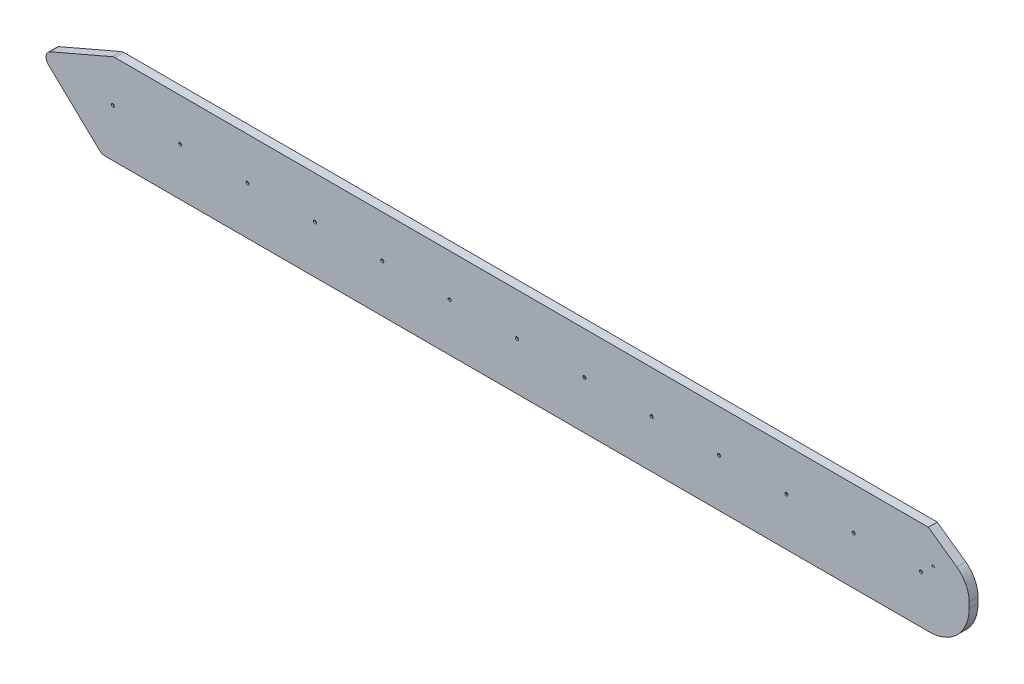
from build123d import *

# Parameters (mm, degrees)
SKETCH1_R                                       = 4
BOSS_EXTRUDE1_DEPTH                             = 15
BOSS_EXTRUDE2_START                             = 15
SKETCH1_11_R                                    = 4
BOSS_EXTRUDE2_DEPTH                             = 15
CSK_FOR_M5_FLAT_HEAD_MACHINE_SCREW2_D           = 5.5
CSK_FOR_M5_FLAT_HEAD_MACHINE_SCREW2_CSINK_D     = 10.4
CSK_FOR_M5_FLAT_HEAD_MACHINE_SCREW2_CSINK_ANGLE = 90
LPATTERN1_COUNT                                 = 13
LPATTERN1_PITCH                                 = 227.61
FILLET1_R                                       = 25
FILLET2_R                                       = 135


with BuildPart() as part:
    # Sketch1 → Boss-Extrude1 (new body)
    with BuildSketch(Plane.XY):
        with BuildLine():
            Line((-3018.475974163, -0.813661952), (-2810.071542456, -198.823390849))
            Line((-2810.071542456, -198.823390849), (121.07262217, -198.823390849))
            Line((121.07262217, -198.823390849), (121.07262217, -43.282571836))
            ThreePointArc((121.07262217, -43.282571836), (109.930228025, 2.590360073), (78.986104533, 38.240606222))
            Line((78.986104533, 38.240606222), (-16.645493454, 106.176609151))
            Line((-16.645493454, 106.176609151), (-2770.644242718, 106.176609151))
            Line((-2770.644242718, 106.176609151), (-3018.475974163, -0.813661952))
        make_face()
        Circle(SKETCH1_R, mode=Mode.SUBTRACT)
        with BuildLine():
            Line((-2495.825190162, -97.616720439), (-2482.049267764, -83.117618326))
            ThreePointArc((-2482.049267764, -83.117618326), (-2480.6756779, -79.545796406), (-2482.230062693, -76.048862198))
            Line((-2482.230062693, -76.048862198), (-2587.348553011, 23.826575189))
            ThreePointArc((-2587.348553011, 23.826575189), (-2590.920374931, 25.200165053), (-2594.417309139, 23.64578026))
            Line((-2594.417309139, 23.64578026), (-2608.193231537, 9.146678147))
            ThreePointArc((-2608.193231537, 9.146678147), (-2609.566821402, 5.574856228), (-2608.012436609, 2.07792202))
            Line((-2608.012436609, 2.07792202), (-2502.89394629, -97.797515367))
            ThreePointArc((-2502.89394629, -97.797515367), (-2499.322124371, -99.171105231), (-2495.825190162, -97.616720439))
        make_face(mode=Mode.SUBTRACT)
        with BuildLine():
            Line((-2711.247212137, -128.823390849), (-2711.247212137, -138.823390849))
            ThreePointArc((-2711.247212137, -138.823390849), (-2709.782746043, -142.358924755), (-2706.247212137, -143.823390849))
            Line((-2706.247212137, -143.823390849), (-11.247212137, -143.823390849))
            ThreePointArc((-11.247212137, -143.823390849), (86.252787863, -46.323390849), (-11.247212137, 51.176609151))
            Line((-11.247212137, 51.176609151), (-2821.247212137, 51.176609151))
            ThreePointArc((-2821.247212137, 51.176609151), (-2824.782746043, 49.712143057), (-2826.247212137, 46.176609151))
            Line((-2826.247212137, 46.176609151), (-2826.247212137, 36.176609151))
            Line((-2826.247212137, 36.176609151), (-11.247212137, 36.176609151))
            ThreePointArc((-11.247212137, 36.176609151), (71.252787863, -46.323390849), (-11.247212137, -128.823390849))
            Line((-11.247212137, -128.823390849), (-2711.247212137, -128.823390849))
        make_face(mode=Mode.SUBTRACT)
        with BuildLine():
            Line((-2268.215190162, -97.616720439), (-2254.439267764, -83.117618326))
            ThreePointArc((-2254.439267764, -83.117618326), (-2253.0656779, -79.545796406), (-2254.620062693, -76.048862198))
            Line((-2254.620062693, -76.048862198), (-2359.738553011, 23.826575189))
            ThreePointArc((-2359.738553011, 23.826575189), (-2363.310374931, 25.200165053), (-2366.807309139, 23.64578026))
            Line((-2366.807309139, 23.64578026), (-2380.583231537, 9.146678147))
            ThreePointArc((-2380.583231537, 9.146678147), (-2381.956821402, 5.574856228), (-2380.402436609, 2.07792202))
            Line((-2380.402436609, 2.07792202), (-2275.28394629, -97.797515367))
            ThreePointArc((-2275.28394629, -97.797515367), (-2271.712124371, -99.171105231), (-2268.215190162, -97.616720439))
        make_face(mode=Mode.SUBTRACT)
        with BuildLine():
            Line((-2040.605190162, -97.616720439), (-2026.829267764, -83.117618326))
            ThreePointArc((-2026.829267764, -83.117618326), (-2025.4556779, -79.545796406), (-2027.010062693, -76.048862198))
            Line((-2027.010062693, -76.048862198), (-2132.128553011, 23.826575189))
            ThreePointArc((-2132.128553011, 23.826575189), (-2135.700374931, 25.200165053), (-2139.197309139, 23.64578026))
            Line((-2139.197309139, 23.64578026), (-2152.973231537, 9.146678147))
            ThreePointArc((-2152.973231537, 9.146678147), (-2154.346821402, 5.574856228), (-2152.792436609, 2.07792202))
            Line((-2152.792436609, 2.07792202), (-2047.67394629, -97.797515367))
            ThreePointArc((-2047.67394629, -97.797515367), (-2044.102124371, -99.171105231), (-2040.605190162, -97.616720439))
        make_face(mode=Mode.SUBTRACT)
        with BuildLine():
            Line((-2723.435190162, -97.616720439), (-2709.659267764, -83.117618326))
            ThreePointArc((-2709.659267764, -83.117618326), (-2708.2856779, -79.545796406), (-2709.840062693, -76.048862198))
            Line((-2709.840062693, -76.048862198), (-2814.958553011, 23.826575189))
            ThreePointArc((-2814.958553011, 23.826575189), (-2818.530374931, 25.200165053), (-2822.027309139, 23.64578026))
            Line((-2822.027309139, 23.64578026), (-2835.803231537, 9.146678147))
            ThreePointArc((-2835.803231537, 9.146678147), (-2837.176821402, 5.574856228), (-2835.622436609, 2.07792202))
            Line((-2835.622436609, 2.07792202), (-2730.50394629, -97.797515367))
            ThreePointArc((-2730.50394629, -97.797515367), (-2726.932124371, -99.171105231), (-2723.435190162, -97.616720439))
        make_face(mode=Mode.SUBTRACT)
        with BuildLine():
            Line((-1812.995190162, -97.616720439), (-1799.219267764, -83.117618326))
            ThreePointArc((-1799.219267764, -83.117618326), (-1797.8456779, -79.545796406), (-1799.400062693, -76.048862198))
            Line((-1799.400062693, -76.048862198), (-1904.518553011, 23.826575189))
            ThreePointArc((-1904.518553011, 23.826575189), (-1908.090374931, 25.200165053), (-1911.587309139, 23.64578026))
            Line((-1911.587309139, 23.64578026), (-1925.363231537, 9.146678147))
            ThreePointArc((-1925.363231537, 9.146678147), (-1926.736821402, 5.574856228), (-1925.182436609, 2.07792202))
            Line((-1925.182436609, 2.07792202), (-1820.06394629, -97.797515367))
            ThreePointArc((-1820.06394629, -97.797515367), (-1816.492124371, -99.171105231), (-1812.995190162, -97.616720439))
        make_face(mode=Mode.SUBTRACT)
        with BuildLine():
            Line((-1585.385190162, -97.616720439), (-1571.609267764, -83.117618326))
            ThreePointArc((-1571.609267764, -83.117618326), (-1570.2356779, -79.545796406), (-1571.790062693, -76.048862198))
            Line((-1571.790062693, -76.048862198), (-1676.908553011, 23.826575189))
            ThreePointArc((-1676.908553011, 23.826575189), (-1680.480374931, 25.200165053), (-1683.977309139, 23.64578026))
            Line((-1683.977309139, 23.64578026), (-1697.753231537, 9.146678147))
            ThreePointArc((-1697.753231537, 9.146678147), (-1699.126821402, 5.574856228), (-1697.572436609, 2.07792202))
            Line((-1697.572436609, 2.07792202), (-1592.45394629, -97.797515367))
            ThreePointArc((-1592.45394629, -97.797515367), (-1588.882124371, -99.171105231), (-1585.385190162, -97.616720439))
        make_face(mode=Mode.SUBTRACT)
        with BuildLine():
            Line((-1357.775190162, -97.616720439), (-1343.999267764, -83.117618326))
            ThreePointArc((-1343.999267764, -83.117618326), (-1342.6256779, -79.545796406), (-1344.180062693, -76.048862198))
            Line((-1344.180062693, -76.048862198), (-1449.298553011, 23.826575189))
            ThreePointArc((-1449.298553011, 23.826575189), (-1452.870374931, 25.200165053), (-1456.367309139, 23.64578026))
            Line((-1456.367309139, 23.64578026), (-1470.143231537, 9.146678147))
            ThreePointArc((-1470.143231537, 9.146678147), (-1471.516821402, 5.574856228), (-1469.962436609, 2.07792202))
            Line((-1469.962436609, 2.07792202), (-1364.84394629, -97.797515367))
            ThreePointArc((-1364.84394629, -97.797515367), (-1361.272124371, -99.171105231), (-1357.775190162, -97.616720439))
        make_face(mode=Mode.SUBTRACT)
        with BuildLine():
            Line((-1130.165190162, -97.616720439), (-1116.389267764, -83.117618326))
            ThreePointArc((-1116.389267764, -83.117618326), (-1115.0156779, -79.545796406), (-1116.570062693, -76.048862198))
            Line((-1116.570062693, -76.048862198), (-1221.688553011, 23.826575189))
            ThreePointArc((-1221.688553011, 23.826575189), (-1225.260374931, 25.200165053), (-1228.757309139, 23.64578026))
            Line((-1228.757309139, 23.64578026), (-1242.533231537, 9.146678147))
            ThreePointArc((-1242.533231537, 9.146678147), (-1243.906821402, 5.574856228), (-1242.352436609, 2.07792202))
            Line((-1242.352436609, 2.07792202), (-1137.23394629, -97.797515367))
            ThreePointArc((-1137.23394629, -97.797515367), (-1133.662124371, -99.171105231), (-1130.165190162, -97.616720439))
        make_face(mode=Mode.SUBTRACT)
        with BuildLine():
            Line((-902.555190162, -97.616720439), (-888.779267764, -83.117618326))
            ThreePointArc((-888.779267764, -83.117618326), (-887.4056779, -79.545796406), (-888.960062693, -76.048862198))
            Line((-888.960062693, -76.048862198), (-994.078553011, 23.826575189))
            ThreePointArc((-994.078553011, 23.826575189), (-997.650374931, 25.200165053), (-1001.147309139, 23.64578026))
            Line((-1001.147309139, 23.64578026), (-1014.923231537, 9.146678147))
            ThreePointArc((-1014.923231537, 9.146678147), (-1016.296821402, 5.574856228), (-1014.742436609, 2.07792202))
            Line((-1014.742436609, 2.07792202), (-909.62394629, -97.797515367))
            ThreePointArc((-909.62394629, -97.797515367), (-906.052124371, -99.171105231), (-902.555190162, -97.616720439))
        make_face(mode=Mode.SUBTRACT)
        with BuildLine():
            Line((-674.945190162, -97.616720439), (-661.169267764, -83.117618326))
            ThreePointArc((-661.169267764, -83.117618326), (-659.7956779, -79.545796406), (-661.350062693, -76.048862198))
            Line((-661.350062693, -76.048862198), (-766.468553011, 23.826575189))
            ThreePointArc((-766.468553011, 23.826575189), (-770.040374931, 25.200165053), (-773.537309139, 23.64578026))
            Line((-773.537309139, 23.64578026), (-787.313231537, 9.146678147))
            ThreePointArc((-787.313231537, 9.146678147), (-788.686821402, 5.574856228), (-787.132436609, 2.07792202))
            Line((-787.132436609, 2.07792202), (-682.01394629, -97.797515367))
            ThreePointArc((-682.01394629, -97.797515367), (-678.442124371, -99.171105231), (-674.945190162, -97.616720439))
        make_face(mode=Mode.SUBTRACT)
        with BuildLine():
            Line((-447.335190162, -97.616720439), (-433.559267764, -83.117618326))
            ThreePointArc((-433.559267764, -83.117618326), (-432.1856779, -79.545796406), (-433.740062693, -76.048862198))
            Line((-433.740062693, -76.048862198), (-538.858553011, 23.826575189))
            ThreePointArc((-538.858553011, 23.826575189), (-542.430374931, 25.200165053), (-545.927309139, 23.64578026))
            Line((-545.927309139, 23.64578026), (-559.703231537, 9.146678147))
            ThreePointArc((-559.703231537, 9.146678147), (-561.076821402, 5.574856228), (-559.522436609, 2.07792202))
            Line((-559.522436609, 2.07792202), (-454.40394629, -97.797515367))
            ThreePointArc((-454.40394629, -97.797515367), (-450.832124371, -99.171105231), (-447.335190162, -97.616720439))
        make_face(mode=Mode.SUBTRACT)
        with BuildLine():
            Line((-219.725190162, -97.616720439), (-205.949267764, -83.117618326))
            ThreePointArc((-205.949267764, -83.117618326), (-204.5756779, -79.545796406), (-206.130062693, -76.048862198))
            Line((-206.130062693, -76.048862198), (-311.248553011, 23.826575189))
            ThreePointArc((-311.248553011, 23.826575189), (-314.820374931, 25.200165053), (-318.317309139, 23.64578026))
            Line((-318.317309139, 23.64578026), (-332.093231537, 9.146678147))
            ThreePointArc((-332.093231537, 9.146678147), (-333.466821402, 5.574856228), (-331.912436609, 2.07792202))
            Line((-331.912436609, 2.07792202), (-226.79394629, -97.797515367))
            ThreePointArc((-226.79394629, -97.797515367), (-223.222124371, -99.171105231), (-219.725190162, -97.616720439))
        make_face(mode=Mode.SUBTRACT)
        with BuildLine():
            Line((7.884809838, -97.616720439), (21.660732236, -83.117618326))
            ThreePointArc((21.660732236, -83.117618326), (23.0343221, -79.545796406), (21.479937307, -76.048862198))
            Line((21.479937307, -76.048862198), (-83.638553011, 23.826575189))
            ThreePointArc((-83.638553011, 23.826575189), (-87.210374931, 25.200165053), (-90.707309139, 23.64578026))
            Line((-90.707309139, 23.64578026), (-104.483231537, 9.146678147))
            ThreePointArc((-104.483231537, 9.146678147), (-105.856821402, 5.574856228), (-104.302436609, 2.07792202))
            Line((-104.302436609, 2.07792202), (0.81605371, -97.797515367))
            ThreePointArc((0.81605371, -97.797515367), (4.387875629, -99.171105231), (7.884809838, -97.616720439))
        make_face(mode=Mode.SUBTRACT)
    extrude(amount=-BOSS_EXTRUDE1_DEPTH)

    # Sketch1_11 → Boss-Extrude2 (add)
    with BuildSketch(Plane.XY.offset(BOSS_EXTRUDE2_START)):
        with BuildLine():
            Line((-3018.475974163, -0.813661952), (-2810.071542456, -198.823390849))
            Line((-2810.071542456, -198.823390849), (121.07262217, -198.823390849))
            Line((121.07262217, -198.823390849), (121.07262217, -43.282571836))
            ThreePointArc((121.07262217, -43.282571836), (109.930228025, 2.590360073), (78.986104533, 38.240606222))
            Line((78.986104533, 38.240606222), (-16.645493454, 106.176609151))
            Line((-16.645493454, 106.176609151), (-2770.644242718, 106.176609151))
            Line((-2770.644242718, 106.176609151), (-3018.475974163, -0.813661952))
        make_face()
        Circle(SKETCH1_11_R, mode=Mode.SUBTRACT)
    extrude(amount=-BOSS_EXTRUDE2_DEPTH)

    # CSK for M5 Flat Head Machine Screw2 (through all)
    with Locations(Plane.XY.offset(15)):
        with Locations((-2772.731249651, -36.985470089)):
            csk_for_m5_flat_head_machine_screw2 = CounterSinkHole(CSK_FOR_M5_FLAT_HEAD_MACHINE_SCREW2_D / 2, CSK_FOR_M5_FLAT_HEAD_MACHINE_SCREW2_CSINK_D / 2, counter_sink_angle=CSK_FOR_M5_FLAT_HEAD_MACHINE_SCREW2_CSINK_ANGLE)

    # LPattern1: CSK for M5 Flat Head Machine Screw2 ×13
    with Locations(*[(i * LPATTERN1_PITCH, 0, 0) for i in range(1, LPATTERN1_COUNT)]):
        add(csk_for_m5_flat_head_machine_screw2, mode=Mode.SUBTRACT)

    # Fillet1
    fillet1_edges = [part.edges().sort_by_distance(p)[0] for p in [
        (-2810.071542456, -198.823390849, 0),
        (-3018.475974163, -0.813661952, 0),
        (-2770.644242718, 106.176609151, 0),
    ]]
    fillet(fillet1_edges, radius=FILLET1_R)

    # Fillet2
    fillet2_edges = [part.edges().sort_by_distance(p)[0] for p in [
        (121.07262217, -198.823390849, 0),
    ]]
    fillet(fillet2_edges, radius=FILLET2_R)


solid = part.part
